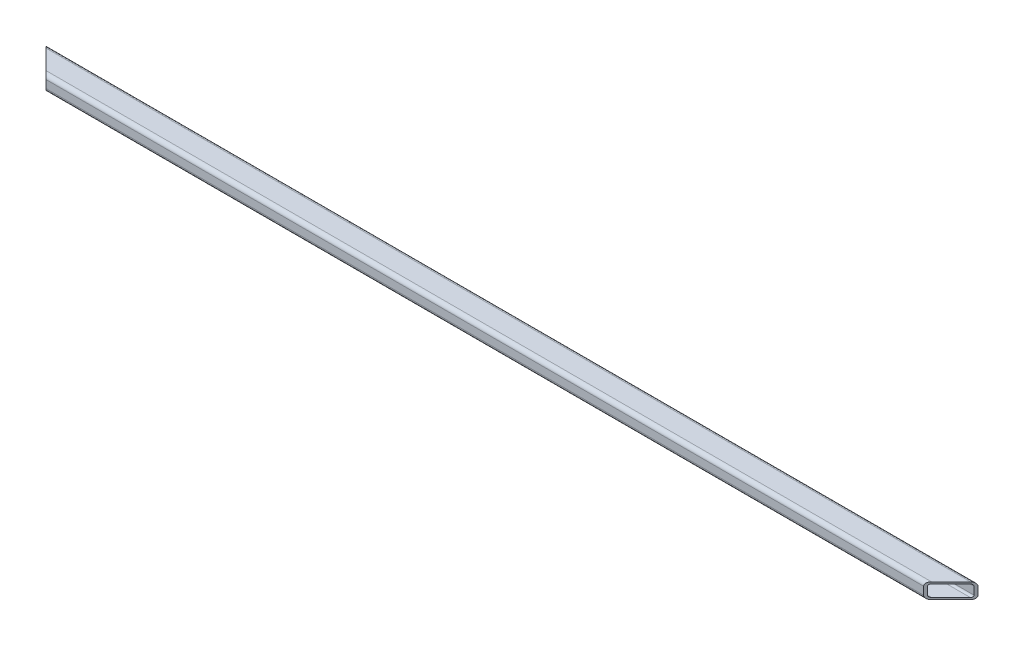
ISO-10303-21;
HEADER;
FILE_DESCRIPTION(('STEP AP214'),'2;1');
FILE_NAME('part.step','',(''),(''),'','','');
FILE_SCHEMA(('AUTOMOTIVE_DESIGN { 1 0 10303 214 1 1 1 1 }'));
ENDSEC;
DATA;
#1=APPLICATION_CONTEXT('core data for automotive mechanical design processes');
#2=APPLICATION_PROTOCOL_DEFINITION('international standard','automotive_design',2000,#1);
#3=PRODUCT_CONTEXT('',#1,'mechanical');
#4=PRODUCT('Part','Part','',(#3));
#5=PRODUCT_RELATED_PRODUCT_CATEGORY('part','',(#4));
#6=PRODUCT_DEFINITION_FORMATION('','',#4);
#7=PRODUCT_DEFINITION_CONTEXT('part definition',#1,'design');
#8=PRODUCT_DEFINITION('design','',#6,#7);
#9=PRODUCT_DEFINITION_SHAPE('','',#8);
#10=(LENGTH_UNIT() NAMED_UNIT(*) SI_UNIT(.MILLI.,.METRE.));
#11=(NAMED_UNIT(*) PLANE_ANGLE_UNIT() SI_UNIT($,.RADIAN.));
#12=(NAMED_UNIT(*) SI_UNIT($,.STERADIAN.) SOLID_ANGLE_UNIT());
#13=UNCERTAINTY_MEASURE_WITH_UNIT(LENGTH_MEASURE(1.E-05),#10,'distance_accuracy_value','');
#14=(GEOMETRIC_REPRESENTATION_CONTEXT(3) GLOBAL_UNCERTAINTY_ASSIGNED_CONTEXT((#13)) GLOBAL_UNIT_ASSIGNED_CONTEXT((#10,
#11,#12)) REPRESENTATION_CONTEXT('',''));
#15=CARTESIAN_POINT('',(0.,0.,0.));
#16=DIRECTION('',(0.,0.,1.));
#17=DIRECTION('',(1.,0.,0.));
#18=AXIS2_PLACEMENT_3D('',#15,#16,#17);
#19=CARTESIAN_POINT('',(1200.,5.,-12.5));
#20=DIRECTION('',(-1.,0.,0.));
#21=DIRECTION('',(0.,0.,1.));
#22=AXIS2_PLACEMENT_3D('',#19,#20,#21);
#23=CYLINDRICAL_SURFACE('',#22,5.);
#24=DIRECTION('',(-1.,0.,0.));
#25=VECTOR('',#24,1.);
#26=CARTESIAN_POINT('',(1200.,5.,-17.5));
#27=LINE('',#26,#25);
#28=CARTESIAN_POINT('',(1200.,5.,-17.5));
#29=VERTEX_POINT('',#28);
#30=CARTESIAN_POINT('',(0.,5.,-17.5));
#31=VERTEX_POINT('',#30);
#32=EDGE_CURVE('E221',#29,#31,#27,.T.);
#33=ORIENTED_EDGE('',*,*,#32,.T.);
#34=CARTESIAN_POINT('',(5.,5.,-12.5));
#35=DIRECTION('',(0.707106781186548,0.,-0.707106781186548));
#36=DIRECTION('',(-0.707106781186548,0.,-0.707106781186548));
#37=AXIS2_PLACEMENT_3D('',#34,#35,#36);
#38=ELLIPSE('',#37,7.07106781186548,5.);
#39=CARTESIAN_POINT('',(5.00000000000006,10.,-12.4999999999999));
#40=VERTEX_POINT('',#39);
#41=EDGE_CURVE('E152',#31,#40,#38,.T.);
#42=ORIENTED_EDGE('',*,*,#41,.T.);
#43=DIRECTION('',(-1.,0.,0.));
#44=VECTOR('',#43,1.);
#45=CARTESIAN_POINT('',(1200.,10.,-12.5));
#46=LINE('',#45,#44);
#47=CARTESIAN_POINT('',(1195.,10.,-12.5));
#48=VERTEX_POINT('',#47);
#49=EDGE_CURVE('E162',#48,#40,#46,.T.);
#50=ORIENTED_EDGE('',*,*,#49,.F.);
#51=CARTESIAN_POINT('',(1195.,5.,-12.5));
#52=DIRECTION('',(-0.707106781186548,0.,-0.707106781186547));
#53=DIRECTION('',(-0.707106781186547,0.,0.707106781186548));
#54=AXIS2_PLACEMENT_3D('',#51,#52,#53);
#55=ELLIPSE('',#54,7.07106781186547,5.);
#56=EDGE_CURVE('E198',#48,#29,#55,.T.);
#57=ORIENTED_EDGE('',*,*,#56,.T.);
#58=EDGE_LOOP('',(#33,#42,#50,#57));
#59=FACE_BOUND('',#58,.T.);
#60=ADVANCED_FACE('F31',(#59),#23,.T.);
#61=CARTESIAN_POINT('',(1200.,10.,12.5));
#62=DIRECTION('',(0.,-1.,0.));
#63=DIRECTION('',(0.,0.,-1.));
#64=AXIS2_PLACEMENT_3D('',#61,#62,#63);
#65=PLANE('',#64);
#66=ORIENTED_EDGE('',*,*,#49,.T.);
#67=DIRECTION('',(-0.707106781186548,0.,-0.707106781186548));
#68=VECTOR('',#67,1.);
#69=CARTESIAN_POINT('',(0.,10.,-17.5));
#70=LINE('',#69,#68);
#71=CARTESIAN_POINT('',(30.,10.,12.5));
#72=VERTEX_POINT('',#71);
#73=EDGE_CURVE('E144',#72,#40,#70,.T.);
#74=ORIENTED_EDGE('',*,*,#73,.F.);
#75=DIRECTION('',(-1.,0.,0.));
#76=VECTOR('',#75,1.);
#77=CARTESIAN_POINT('',(1200.,10.,12.5));
#78=LINE('',#77,#76);
#79=CARTESIAN_POINT('',(1170.,10.,12.5));
#80=VERTEX_POINT('',#79);
#81=EDGE_CURVE('E160',#80,#72,#78,.T.);
#82=ORIENTED_EDGE('',*,*,#81,.F.);
#83=DIRECTION('',(-0.707106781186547,0.,0.707106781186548));
#84=VECTOR('',#83,1.);
#85=CARTESIAN_POINT('',(1200.,10.,-17.5));
#86=LINE('',#85,#84);
#87=EDGE_CURVE('E265',#48,#80,#86,.T.);
#88=ORIENTED_EDGE('',*,*,#87,.F.);
#89=EDGE_LOOP('',(#66,#74,#82,#88));
#90=FACE_BOUND('',#89,.T.);
#91=ADVANCED_FACE('F158',(#90),#65,.F.);
#92=CARTESIAN_POINT('',(1200.,5.,12.5));
#93=DIRECTION('',(-1.,0.,0.));
#94=DIRECTION('',(0.,0.,1.));
#95=AXIS2_PLACEMENT_3D('',#92,#93,#94);
#96=CYLINDRICAL_SURFACE('',#95,5.);
#97=ORIENTED_EDGE('',*,*,#81,.T.);
#98=CARTESIAN_POINT('',(30.,5.,12.5));
#99=DIRECTION('',(0.707106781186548,0.,-0.707106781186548));
#100=DIRECTION('',(-0.707106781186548,0.,-0.707106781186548));
#101=AXIS2_PLACEMENT_3D('',#98,#99,#100);
#102=ELLIPSE('',#101,7.07106781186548,5.);
#103=CARTESIAN_POINT('',(35.,5.,17.5));
#104=VERTEX_POINT('',#103);
#105=EDGE_CURVE('E141',#72,#104,#102,.T.);
#106=ORIENTED_EDGE('',*,*,#105,.T.);
#107=DIRECTION('',(-1.,0.,0.));
#108=VECTOR('',#107,1.);
#109=CARTESIAN_POINT('',(1200.,5.,17.5));
#110=LINE('',#109,#108);
#111=CARTESIAN_POINT('',(1165.,5.,17.5));
#112=VERTEX_POINT('',#111);
#113=EDGE_CURVE('E168',#112,#104,#110,.T.);
#114=ORIENTED_EDGE('',*,*,#113,.F.);
#115=CARTESIAN_POINT('',(1170.,5.,12.5));
#116=DIRECTION('',(-0.707106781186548,0.,-0.707106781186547));
#117=DIRECTION('',(-0.707106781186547,0.,0.707106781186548));
#118=AXIS2_PLACEMENT_3D('',#115,#116,#117);
#119=ELLIPSE('',#118,7.07106781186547,5.);
#120=EDGE_CURVE('E167',#112,#80,#119,.T.);
#121=ORIENTED_EDGE('',*,*,#120,.T.);
#122=EDGE_LOOP('',(#97,#106,#114,#121));
#123=FACE_BOUND('',#122,.T.);
#124=ADVANCED_FACE('F166',(#123),#96,.T.);
#125=CARTESIAN_POINT('',(1200.,5.,17.5));
#126=DIRECTION('',(0.,0.,-1.));
#127=DIRECTION('',(-1.,0.,0.));
#128=AXIS2_PLACEMENT_3D('',#125,#126,#127);
#129=PLANE('',#128);
#130=ORIENTED_EDGE('',*,*,#113,.T.);
#131=DIRECTION('',(0.,1.,0.));
#132=VECTOR('',#131,1.);
#133=CARTESIAN_POINT('',(35.,-10.,17.5));
#134=LINE('',#133,#132);
#135=CARTESIAN_POINT('',(35.,-5.,17.5));
#136=VERTEX_POINT('',#135);
#137=EDGE_CURVE('E147',#136,#104,#134,.T.);
#138=ORIENTED_EDGE('',*,*,#137,.F.);
#139=DIRECTION('',(-1.,0.,0.));
#140=VECTOR('',#139,1.);
#141=CARTESIAN_POINT('',(1200.,-5.,17.5));
#142=LINE('',#141,#140);
#143=CARTESIAN_POINT('',(1165.,-5.,17.5));
#144=VERTEX_POINT('',#143);
#145=EDGE_CURVE('E171',#144,#136,#142,.T.);
#146=ORIENTED_EDGE('',*,*,#145,.F.);
#147=DIRECTION('',(0.,1.,0.));
#148=VECTOR('',#147,1.);
#149=CARTESIAN_POINT('',(1165.,-10.,17.5));
#150=LINE('',#149,#148);
#151=EDGE_CURVE('E191',#144,#112,#150,.T.);
#152=ORIENTED_EDGE('',*,*,#151,.T.);
#153=EDGE_LOOP('',(#130,#138,#146,#152));
#154=FACE_BOUND('',#153,.T.);
#155=ADVANCED_FACE('F242',(#154),#129,.F.);
#156=CARTESIAN_POINT('',(1200.,-5.,12.5));
#157=DIRECTION('',(-1.,0.,0.));
#158=DIRECTION('',(0.,0.,1.));
#159=AXIS2_PLACEMENT_3D('',#156,#157,#158);
#160=CYLINDRICAL_SURFACE('',#159,5.);
#161=ORIENTED_EDGE('',*,*,#145,.T.);
#162=CARTESIAN_POINT('',(30.,-5.,12.5));
#163=DIRECTION('',(0.707106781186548,0.,-0.707106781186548));
#164=DIRECTION('',(-0.707106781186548,0.,-0.707106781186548));
#165=AXIS2_PLACEMENT_3D('',#162,#163,#164);
#166=ELLIPSE('',#165,7.07106781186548,5.);
#167=CARTESIAN_POINT('',(30.0000000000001,-10.,12.5000000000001));
#168=VERTEX_POINT('',#167);
#169=EDGE_CURVE('E153',#136,#168,#166,.T.);
#170=ORIENTED_EDGE('',*,*,#169,.T.);
#171=DIRECTION('',(-1.,0.,0.));
#172=VECTOR('',#171,1.);
#173=CARTESIAN_POINT('',(1200.,-10.,12.5));
#174=LINE('',#173,#172);
#175=CARTESIAN_POINT('',(1170.,-10.,12.4999999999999));
#176=VERTEX_POINT('',#175);
#177=EDGE_CURVE('E230',#176,#168,#174,.T.);
#178=ORIENTED_EDGE('',*,*,#177,.F.);
#179=CARTESIAN_POINT('',(1170.,-5.,12.5));
#180=DIRECTION('',(-0.707106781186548,0.,-0.707106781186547));
#181=DIRECTION('',(-0.707106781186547,0.,0.707106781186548));
#182=AXIS2_PLACEMENT_3D('',#179,#180,#181);
#183=ELLIPSE('',#182,7.07106781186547,5.);
#184=EDGE_CURVE('E239',#176,#144,#183,.T.);
#185=ORIENTED_EDGE('',*,*,#184,.T.);
#186=EDGE_LOOP('',(#161,#170,#178,#185));
#187=FACE_BOUND('',#186,.T.);
#188=ADVANCED_FACE('F237',(#187),#160,.T.);
#189=CARTESIAN_POINT('',(1200.,-10.,12.5));
#190=DIRECTION('',(0.,1.,0.));
#191=DIRECTION('',(0.,0.,1.));
#192=AXIS2_PLACEMENT_3D('',#189,#190,#191);
#193=PLANE('',#192);
#194=ORIENTED_EDGE('',*,*,#177,.T.);
#195=DIRECTION('',(-0.707106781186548,0.,-0.707106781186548));
#196=VECTOR('',#195,1.);
#197=CARTESIAN_POINT('',(0.,-10.,-17.5));
#198=LINE('',#197,#196);
#199=CARTESIAN_POINT('',(4.99999999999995,-10.,-12.5));
#200=VERTEX_POINT('',#199);
#201=EDGE_CURVE('E163',#168,#200,#198,.T.);
#202=ORIENTED_EDGE('',*,*,#201,.T.);
#203=DIRECTION('',(-1.,0.,0.));
#204=VECTOR('',#203,1.);
#205=CARTESIAN_POINT('',(1200.,-10.,-12.5));
#206=LINE('',#205,#204);
#207=CARTESIAN_POINT('',(1195.,-10.,-12.5));
#208=VERTEX_POINT('',#207);
#209=EDGE_CURVE('E227',#208,#200,#206,.T.);
#210=ORIENTED_EDGE('',*,*,#209,.F.);
#211=DIRECTION('',(-0.707106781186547,0.,0.707106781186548));
#212=VECTOR('',#211,1.);
#213=CARTESIAN_POINT('',(1200.,-10.,-17.5));
#214=LINE('',#213,#212);
#215=EDGE_CURVE('E267',#208,#176,#214,.T.);
#216=ORIENTED_EDGE('',*,*,#215,.T.);
#217=EDGE_LOOP('',(#194,#202,#210,#216));
#218=FACE_BOUND('',#217,.T.);
#219=ADVANCED_FACE('F296',(#218),#193,.F.);
#220=CARTESIAN_POINT('',(1200.,-5.,-12.5));
#221=DIRECTION('',(-1.,0.,0.));
#222=DIRECTION('',(0.,0.,1.));
#223=AXIS2_PLACEMENT_3D('',#220,#221,#222);
#224=CYLINDRICAL_SURFACE('',#223,5.);
#225=ORIENTED_EDGE('',*,*,#209,.T.);
#226=CARTESIAN_POINT('',(5.,-5.,-12.5));
#227=DIRECTION('',(0.707106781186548,0.,-0.707106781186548));
#228=DIRECTION('',(-0.707106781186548,0.,-0.707106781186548));
#229=AXIS2_PLACEMENT_3D('',#226,#227,#228);
#230=ELLIPSE('',#229,7.07106781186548,5.);
#231=CARTESIAN_POINT('',(0.,-5.,-17.5));
#232=VERTEX_POINT('',#231);
#233=EDGE_CURVE('E260',#200,#232,#230,.T.);
#234=ORIENTED_EDGE('',*,*,#233,.T.);
#235=DIRECTION('',(-1.,0.,0.));
#236=VECTOR('',#235,1.);
#237=CARTESIAN_POINT('',(1200.,-5.,-17.5));
#238=LINE('',#237,#236);
#239=CARTESIAN_POINT('',(1200.,-5.,-17.5));
#240=VERTEX_POINT('',#239);
#241=EDGE_CURVE('E224',#240,#232,#238,.T.);
#242=ORIENTED_EDGE('',*,*,#241,.F.);
#243=CARTESIAN_POINT('',(1195.,-5.,-12.5));
#244=DIRECTION('',(-0.707106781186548,0.,-0.707106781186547));
#245=DIRECTION('',(-0.707106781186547,0.,0.707106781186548));
#246=AXIS2_PLACEMENT_3D('',#243,#244,#245);
#247=ELLIPSE('',#246,7.07106781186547,5.);
#248=EDGE_CURVE('E281',#240,#208,#247,.T.);
#249=ORIENTED_EDGE('',*,*,#248,.T.);
#250=EDGE_LOOP('',(#225,#234,#242,#249));
#251=FACE_BOUND('',#250,.T.);
#252=ADVANCED_FACE('F293',(#251),#224,.T.);
#253=CARTESIAN_POINT('',(1200.,5.,-17.5));
#254=DIRECTION('',(0.,0.,1.));
#255=DIRECTION('',(1.,0.,0.));
#256=AXIS2_PLACEMENT_3D('',#253,#254,#255);
#257=PLANE('',#256);
#258=DIRECTION('',(0.,1.,0.));
#259=VECTOR('',#258,1.);
#260=CARTESIAN_POINT('',(0.,5.,-17.5));
#261=LINE('',#260,#259);
#262=EDGE_CURVE('E216',#232,#31,#261,.T.);
#263=ORIENTED_EDGE('',*,*,#262,.T.);
#264=ORIENTED_EDGE('',*,*,#32,.F.);
#265=DIRECTION('',(0.,1.,0.));
#266=VECTOR('',#265,1.);
#267=CARTESIAN_POINT('',(1200.,5.,-17.5));
#268=LINE('',#267,#266);
#269=EDGE_CURVE('E219',#240,#29,#268,.T.);
#270=ORIENTED_EDGE('',*,*,#269,.F.);
#271=ORIENTED_EDGE('',*,*,#241,.T.);
#272=EDGE_LOOP('',(#263,#264,#270,#271));
#273=FACE_BOUND('',#272,.T.);
#274=ADVANCED_FACE('F290',(#273),#257,.F.);
#275=CARTESIAN_POINT('',(1200.,5.,12.5));
#276=DIRECTION('',(-1.,0.,0.));
#277=DIRECTION('',(0.,0.,1.));
#278=AXIS2_PLACEMENT_3D('',#275,#276,#277);
#279=CYLINDRICAL_SURFACE('',#278,2.5);
#280=CARTESIAN_POINT('',(30.,5.,12.5));
#281=DIRECTION('',(0.707106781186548,0.,-0.707106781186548));
#282=DIRECTION('',(-0.707106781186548,0.,-0.707106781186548));
#283=AXIS2_PLACEMENT_3D('',#280,#281,#282);
#284=ELLIPSE('',#283,3.53553390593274,2.5);
#285=CARTESIAN_POINT('',(30.0000000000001,7.5,12.5000000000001));
#286=VERTEX_POINT('',#285);
#287=CARTESIAN_POINT('',(32.5,5.,15.));
#288=VERTEX_POINT('',#287);
#289=EDGE_CURVE('E258',#286,#288,#284,.T.);
#290=ORIENTED_EDGE('',*,*,#289,.F.);
#291=DIRECTION('',(-1.,0.,0.));
#292=VECTOR('',#291,1.);
#293=CARTESIAN_POINT('',(1200.,7.5,12.5));
#294=LINE('',#293,#292);
#295=CARTESIAN_POINT('',(1170.,7.5,12.5));
#296=VERTEX_POINT('',#295);
#297=EDGE_CURVE('E194',#296,#286,#294,.T.);
#298=ORIENTED_EDGE('',*,*,#297,.F.);
#299=CARTESIAN_POINT('',(1170.,5.,12.5));
#300=DIRECTION('',(-0.707106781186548,0.,-0.707106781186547));
#301=DIRECTION('',(-0.707106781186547,0.,0.707106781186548));
#302=AXIS2_PLACEMENT_3D('',#299,#300,#301);
#303=ELLIPSE('',#302,3.53553390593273,2.5);
#304=CARTESIAN_POINT('',(1167.5,5.,15.));
#305=VERTEX_POINT('',#304);
#306=EDGE_CURVE('E52',#305,#296,#303,.T.);
#307=ORIENTED_EDGE('',*,*,#306,.F.);
#308=DIRECTION('',(-1.,0.,0.));
#309=VECTOR('',#308,1.);
#310=CARTESIAN_POINT('',(1200.,5.,15.));
#311=LINE('',#310,#309);
#312=EDGE_CURVE('E213',#305,#288,#311,.T.);
#313=ORIENTED_EDGE('',*,*,#312,.T.);
#314=EDGE_LOOP('',(#290,#298,#307,#313));
#315=FACE_BOUND('',#314,.T.);
#316=ADVANCED_FACE('F324',(#315),#279,.F.);
#317=CARTESIAN_POINT('',(1200.,5.,15.));
#318=DIRECTION('',(0.,0.,-1.));
#319=DIRECTION('',(-1.,0.,0.));
#320=AXIS2_PLACEMENT_3D('',#317,#318,#319);
#321=PLANE('',#320);
#322=DIRECTION('',(0.,-1.,0.));
#323=VECTOR('',#322,1.);
#324=CARTESIAN_POINT('',(32.5,5.,15.));
#325=LINE('',#324,#323);
#326=CARTESIAN_POINT('',(32.5,-5.,15.));
#327=VERTEX_POINT('',#326);
#328=EDGE_CURVE('E256',#288,#327,#325,.T.);
#329=ORIENTED_EDGE('',*,*,#328,.F.);
#330=ORIENTED_EDGE('',*,*,#312,.F.);
#331=DIRECTION('',(0.,1.,0.));
#332=VECTOR('',#331,1.);
#333=CARTESIAN_POINT('',(1167.5,5.,15.));
#334=LINE('',#333,#332);
#335=CARTESIAN_POINT('',(1167.5,-5.,15.));
#336=VERTEX_POINT('',#335);
#337=EDGE_CURVE('E278',#336,#305,#334,.T.);
#338=ORIENTED_EDGE('',*,*,#337,.F.);
#339=DIRECTION('',(-1.,0.,0.));
#340=VECTOR('',#339,1.);
#341=CARTESIAN_POINT('',(1200.,-5.,15.));
#342=LINE('',#341,#340);
#343=EDGE_CURVE('E210',#336,#327,#342,.T.);
#344=ORIENTED_EDGE('',*,*,#343,.T.);
#345=EDGE_LOOP('',(#329,#330,#338,#344));
#346=FACE_BOUND('',#345,.T.);
#347=ADVANCED_FACE('F327',(#346),#321,.T.);
#348=CARTESIAN_POINT('',(1200.,-5.,12.5));
#349=DIRECTION('',(-1.,0.,0.));
#350=DIRECTION('',(0.,0.,1.));
#351=AXIS2_PLACEMENT_3D('',#348,#349,#350);
#352=CYLINDRICAL_SURFACE('',#351,2.5);
#353=CARTESIAN_POINT('',(30.,-5.,12.5));
#354=DIRECTION('',(0.707106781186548,0.,-0.707106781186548));
#355=DIRECTION('',(-0.707106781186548,0.,-0.707106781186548));
#356=AXIS2_PLACEMENT_3D('',#353,#354,#355);
#357=ELLIPSE('',#356,3.53553390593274,2.5);
#358=CARTESIAN_POINT('',(30.0000000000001,-7.5,12.5000000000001));
#359=VERTEX_POINT('',#358);
#360=EDGE_CURVE('E254',#327,#359,#357,.T.);
#361=ORIENTED_EDGE('',*,*,#360,.F.);
#362=ORIENTED_EDGE('',*,*,#343,.F.);
#363=CARTESIAN_POINT('',(1170.,-5.,12.5));
#364=DIRECTION('',(-0.707106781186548,0.,-0.707106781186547));
#365=DIRECTION('',(-0.707106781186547,0.,0.707106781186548));
#366=AXIS2_PLACEMENT_3D('',#363,#364,#365);
#367=ELLIPSE('',#366,3.53553390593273,2.5);
#368=CARTESIAN_POINT('',(1170.,-7.5,12.5));
#369=VERTEX_POINT('',#368);
#370=EDGE_CURVE('E276',#369,#336,#367,.T.);
#371=ORIENTED_EDGE('',*,*,#370,.F.);
#372=DIRECTION('',(-1.,0.,0.));
#373=VECTOR('',#372,1.);
#374=CARTESIAN_POINT('',(1200.,-7.5,12.5));
#375=LINE('',#374,#373);
#376=EDGE_CURVE('E207',#369,#359,#375,.T.);
#377=ORIENTED_EDGE('',*,*,#376,.T.);
#378=EDGE_LOOP('',(#361,#362,#371,#377));
#379=FACE_BOUND('',#378,.T.);
#380=ADVANCED_FACE('F331',(#379),#352,.F.);
#381=CARTESIAN_POINT('',(1200.,-7.5,12.5));
#382=DIRECTION('',(0.,1.,0.));
#383=DIRECTION('',(0.,0.,1.));
#384=AXIS2_PLACEMENT_3D('',#381,#382,#383);
#385=PLANE('',#384);
#386=DIRECTION('',(-0.707106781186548,0.,-0.707106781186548));
#387=VECTOR('',#386,1.);
#388=CARTESIAN_POINT('',(615.,-7.5,597.5));
#389=LINE('',#388,#387);
#390=CARTESIAN_POINT('',(5.,-7.5,-12.5));
#391=VERTEX_POINT('',#390);
#392=EDGE_CURVE('E252',#359,#391,#389,.T.);
#393=ORIENTED_EDGE('',*,*,#392,.F.);
#394=ORIENTED_EDGE('',*,*,#376,.F.);
#395=DIRECTION('',(-0.707106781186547,0.,0.707106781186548));
#396=VECTOR('',#395,1.);
#397=CARTESIAN_POINT('',(1185.,-7.5,-2.49999999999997));
#398=LINE('',#397,#396);
#399=CARTESIAN_POINT('',(1195.,-7.5,-12.5));
#400=VERTEX_POINT('',#399);
#401=EDGE_CURVE('E274',#400,#369,#398,.T.);
#402=ORIENTED_EDGE('',*,*,#401,.F.);
#403=DIRECTION('',(-1.,0.,0.));
#404=VECTOR('',#403,1.);
#405=CARTESIAN_POINT('',(1200.,-7.5,-12.5));
#406=LINE('',#405,#404);
#407=EDGE_CURVE('E204',#400,#391,#406,.T.);
#408=ORIENTED_EDGE('',*,*,#407,.T.);
#409=EDGE_LOOP('',(#393,#394,#402,#408));
#410=FACE_BOUND('',#409,.T.);
#411=ADVANCED_FACE('F335',(#410),#385,.T.);
#412=CARTESIAN_POINT('',(1200.,-5.,-12.5));
#413=DIRECTION('',(-1.,0.,0.));
#414=DIRECTION('',(0.,0.,1.));
#415=AXIS2_PLACEMENT_3D('',#412,#413,#414);
#416=CYLINDRICAL_SURFACE('',#415,2.5);
#417=CARTESIAN_POINT('',(5.,-5.,-12.5));
#418=DIRECTION('',(0.707106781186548,0.,-0.707106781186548));
#419=DIRECTION('',(-0.707106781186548,0.,-0.707106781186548));
#420=AXIS2_PLACEMENT_3D('',#417,#418,#419);
#421=ELLIPSE('',#420,3.53553390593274,2.5);
#422=CARTESIAN_POINT('',(2.5,-5.,-15.));
#423=VERTEX_POINT('',#422);
#424=EDGE_CURVE('E250',#391,#423,#421,.T.);
#425=ORIENTED_EDGE('',*,*,#424,.F.);
#426=ORIENTED_EDGE('',*,*,#407,.F.);
#427=CARTESIAN_POINT('',(1195.,-5.,-12.5));
#428=DIRECTION('',(-0.707106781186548,0.,-0.707106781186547));
#429=DIRECTION('',(-0.707106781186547,0.,0.707106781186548));
#430=AXIS2_PLACEMENT_3D('',#427,#428,#429);
#431=ELLIPSE('',#430,3.53553390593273,2.5);
#432=CARTESIAN_POINT('',(1197.5,-5.,-15.));
#433=VERTEX_POINT('',#432);
#434=EDGE_CURVE('E272',#433,#400,#431,.T.);
#435=ORIENTED_EDGE('',*,*,#434,.F.);
#436=DIRECTION('',(-1.,0.,0.));
#437=VECTOR('',#436,1.);
#438=CARTESIAN_POINT('',(1200.,-5.,-15.));
#439=LINE('',#438,#437);
#440=EDGE_CURVE('E196',#433,#423,#439,.T.);
#441=ORIENTED_EDGE('',*,*,#440,.T.);
#442=EDGE_LOOP('',(#425,#426,#435,#441));
#443=FACE_BOUND('',#442,.T.);
#444=ADVANCED_FACE('F339',(#443),#416,.F.);
#445=CARTESIAN_POINT('',(1200.,5.,-15.));
#446=DIRECTION('',(0.,0.,1.));
#447=DIRECTION('',(1.,0.,0.));
#448=AXIS2_PLACEMENT_3D('',#445,#446,#447);
#449=PLANE('',#448);
#450=DIRECTION('',(0.,1.,0.));
#451=VECTOR('',#450,1.);
#452=CARTESIAN_POINT('',(2.5,5.,-15.));
#453=LINE('',#452,#451);
#454=CARTESIAN_POINT('',(2.5,5.,-15.));
#455=VERTEX_POINT('',#454);
#456=EDGE_CURVE('E244',#423,#455,#453,.T.);
#457=ORIENTED_EDGE('',*,*,#456,.F.);
#458=ORIENTED_EDGE('',*,*,#440,.F.);
#459=DIRECTION('',(0.,-1.,0.));
#460=VECTOR('',#459,1.);
#461=CARTESIAN_POINT('',(1197.5,5.,-15.));
#462=LINE('',#461,#460);
#463=CARTESIAN_POINT('',(1197.5,5.,-15.));
#464=VERTEX_POINT('',#463);
#465=EDGE_CURVE('E190',#464,#433,#462,.T.);
#466=ORIENTED_EDGE('',*,*,#465,.F.);
#467=DIRECTION('',(-1.,0.,0.));
#468=VECTOR('',#467,1.);
#469=CARTESIAN_POINT('',(1200.,5.,-15.));
#470=LINE('',#469,#468);
#471=EDGE_CURVE('E189',#464,#455,#470,.T.);
#472=ORIENTED_EDGE('',*,*,#471,.T.);
#473=EDGE_LOOP('',(#457,#458,#466,#472));
#474=FACE_BOUND('',#473,.T.);
#475=ADVANCED_FACE('F343',(#474),#449,.T.);
#476=CARTESIAN_POINT('',(1200.,5.,-12.5));
#477=DIRECTION('',(-1.,0.,0.));
#478=DIRECTION('',(0.,0.,1.));
#479=AXIS2_PLACEMENT_3D('',#476,#477,#478);
#480=CYLINDRICAL_SURFACE('',#479,2.5);
#481=CARTESIAN_POINT('',(5.,5.,-12.5));
#482=DIRECTION('',(0.707106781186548,0.,-0.707106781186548));
#483=DIRECTION('',(-0.707106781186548,0.,-0.707106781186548));
#484=AXIS2_PLACEMENT_3D('',#481,#482,#483);
#485=ELLIPSE('',#484,3.53553390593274,2.5);
#486=CARTESIAN_POINT('',(5.0000000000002,7.5,-12.5));
#487=VERTEX_POINT('',#486);
#488=EDGE_CURVE('E44',#455,#487,#485,.T.);
#489=ORIENTED_EDGE('',*,*,#488,.F.);
#490=ORIENTED_EDGE('',*,*,#471,.F.);
#491=CARTESIAN_POINT('',(1195.,5.,-12.5));
#492=DIRECTION('',(-0.707106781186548,0.,-0.707106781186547));
#493=DIRECTION('',(-0.707106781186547,0.,0.707106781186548));
#494=AXIS2_PLACEMENT_3D('',#491,#492,#493);
#495=ELLIPSE('',#494,3.53553390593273,2.5);
#496=CARTESIAN_POINT('',(1195.,7.5,-12.5));
#497=VERTEX_POINT('',#496);
#498=EDGE_CURVE('E177',#497,#464,#495,.T.);
#499=ORIENTED_EDGE('',*,*,#498,.F.);
#500=DIRECTION('',(-1.,0.,0.));
#501=VECTOR('',#500,1.);
#502=CARTESIAN_POINT('',(1200.,7.5,-12.5));
#503=LINE('',#502,#501);
#504=EDGE_CURVE('E187',#497,#487,#503,.T.);
#505=ORIENTED_EDGE('',*,*,#504,.T.);
#506=EDGE_LOOP('',(#489,#490,#499,#505));
#507=FACE_BOUND('',#506,.T.);
#508=ADVANCED_FACE('F186',(#507),#480,.F.);
#509=CARTESIAN_POINT('',(1200.,7.5,12.5));
#510=DIRECTION('',(0.,-1.,0.));
#511=DIRECTION('',(0.,0.,-1.));
#512=AXIS2_PLACEMENT_3D('',#509,#510,#511);
#513=PLANE('',#512);
#514=DIRECTION('',(0.707106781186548,0.,0.707106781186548));
#515=VECTOR('',#514,1.);
#516=CARTESIAN_POINT('',(615.,7.5,597.5));
#517=LINE('',#516,#515);
#518=EDGE_CURVE('E11',#487,#286,#517,.T.);
#519=ORIENTED_EDGE('',*,*,#518,.F.);
#520=ORIENTED_EDGE('',*,*,#504,.F.);
#521=DIRECTION('',(0.707106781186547,0.,-0.707106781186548));
#522=VECTOR('',#521,1.);
#523=CARTESIAN_POINT('',(1185.,7.5,-2.49999999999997));
#524=LINE('',#523,#522);
#525=EDGE_CURVE('E38',#296,#497,#524,.T.);
#526=ORIENTED_EDGE('',*,*,#525,.F.);
#527=ORIENTED_EDGE('',*,*,#297,.T.);
#528=EDGE_LOOP('',(#519,#520,#526,#527));
#529=FACE_BOUND('',#528,.T.);
#530=ADVANCED_FACE('F193',(#529),#513,.T.);
#531=CARTESIAN_POINT('',(1200.,-10.,-17.5));
#532=DIRECTION('',(-0.707106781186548,0.,-0.707106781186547));
#533=DIRECTION('',(-0.707106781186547,0.,0.707106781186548));
#534=AXIS2_PLACEMENT_3D('',#531,#532,#533);
#535=PLANE('',#534);
#536=ORIENTED_EDGE('',*,*,#306,.T.);
#537=ORIENTED_EDGE('',*,*,#525,.T.);
#538=ORIENTED_EDGE('',*,*,#498,.T.);
#539=ORIENTED_EDGE('',*,*,#465,.T.);
#540=ORIENTED_EDGE('',*,*,#434,.T.);
#541=ORIENTED_EDGE('',*,*,#401,.T.);
#542=ORIENTED_EDGE('',*,*,#370,.T.);
#543=ORIENTED_EDGE('',*,*,#337,.T.);
#544=EDGE_LOOP('',(#536,#537,#538,#539,#540,#541,#542,#543));
#545=FACE_BOUND('',#544,.T.);
#546=ORIENTED_EDGE('',*,*,#87,.T.);
#547=ORIENTED_EDGE('',*,*,#120,.F.);
#548=ORIENTED_EDGE('',*,*,#151,.F.);
#549=ORIENTED_EDGE('',*,*,#184,.F.);
#550=ORIENTED_EDGE('',*,*,#215,.F.);
#551=ORIENTED_EDGE('',*,*,#248,.F.);
#552=ORIENTED_EDGE('',*,*,#269,.T.);
#553=ORIENTED_EDGE('',*,*,#56,.F.);
#554=EDGE_LOOP('',(#546,#547,#548,#549,#550,#551,#552,#553));
#555=FACE_BOUND('',#554,.T.);
#556=ADVANCED_FACE('F175',(#545,#555),#535,.F.);
#557=CARTESIAN_POINT('',(0.,-10.,-17.5));
#558=DIRECTION('',(0.707106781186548,0.,-0.707106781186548));
#559=DIRECTION('',(-0.707106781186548,0.,-0.707106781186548));
#560=AXIS2_PLACEMENT_3D('',#557,#558,#559);
#561=PLANE('',#560);
#562=ORIENTED_EDGE('',*,*,#289,.T.);
#563=ORIENTED_EDGE('',*,*,#328,.T.);
#564=ORIENTED_EDGE('',*,*,#360,.T.);
#565=ORIENTED_EDGE('',*,*,#392,.T.);
#566=ORIENTED_EDGE('',*,*,#424,.T.);
#567=ORIENTED_EDGE('',*,*,#456,.T.);
#568=ORIENTED_EDGE('',*,*,#488,.T.);
#569=ORIENTED_EDGE('',*,*,#518,.T.);
#570=EDGE_LOOP('',(#562,#563,#564,#565,#566,#567,#568,#569));
#571=FACE_BOUND('',#570,.T.);
#572=ORIENTED_EDGE('',*,*,#262,.F.);
#573=ORIENTED_EDGE('',*,*,#233,.F.);
#574=ORIENTED_EDGE('',*,*,#201,.F.);
#575=ORIENTED_EDGE('',*,*,#169,.F.);
#576=ORIENTED_EDGE('',*,*,#137,.T.);
#577=ORIENTED_EDGE('',*,*,#105,.F.);
#578=ORIENTED_EDGE('',*,*,#73,.T.);
#579=ORIENTED_EDGE('',*,*,#41,.F.);
#580=EDGE_LOOP('',(#572,#573,#574,#575,#576,#577,#578,#579));
#581=FACE_BOUND('',#580,.T.);
#582=ADVANCED_FACE('F143',(#571,#581),#561,.F.);
#583=CLOSED_SHELL('',(#60,#91,#124,#155,#188,#219,#252,#274,#316,#347,#380,#411,#444,#475,#508,
#530,#556,#582));
#584=MANIFOLD_SOLID_BREP('B2',#583);
#585=ADVANCED_BREP_SHAPE_REPRESENTATION('',(#18,#584),#14);
#586=SHAPE_DEFINITION_REPRESENTATION(#9,#585);
ENDSEC;
END-ISO-10303-21;
